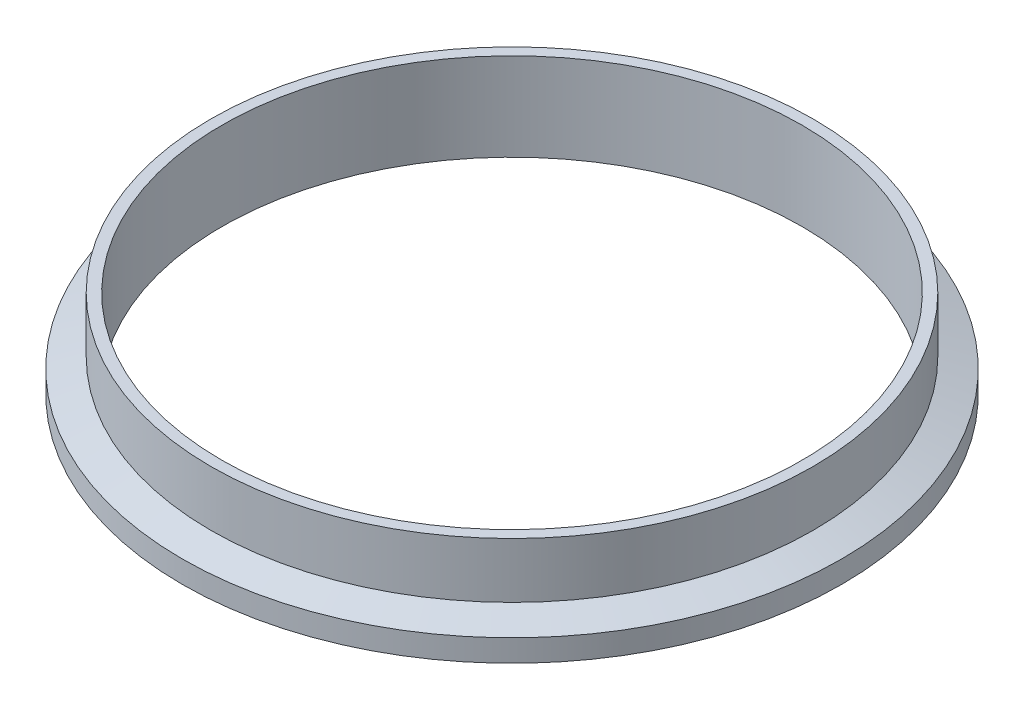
ISO-10303-21;
HEADER;
FILE_DESCRIPTION(('STEP AP214'),'2;1');
FILE_NAME('part.step','',(''),(''),'','','');
FILE_SCHEMA(('AUTOMOTIVE_DESIGN { 1 0 10303 214 1 1 1 1 }'));
ENDSEC;
DATA;
#1=APPLICATION_CONTEXT('core data for automotive mechanical design processes');
#2=APPLICATION_PROTOCOL_DEFINITION('international standard','automotive_design',2000,#1);
#3=PRODUCT_CONTEXT('',#1,'mechanical');
#4=PRODUCT('Part','Part','',(#3));
#5=PRODUCT_RELATED_PRODUCT_CATEGORY('part','',(#4));
#6=PRODUCT_DEFINITION_FORMATION('','',#4);
#7=PRODUCT_DEFINITION_CONTEXT('part definition',#1,'design');
#8=PRODUCT_DEFINITION('design','',#6,#7);
#9=PRODUCT_DEFINITION_SHAPE('','',#8);
#10=(LENGTH_UNIT() NAMED_UNIT(*) SI_UNIT(.MILLI.,.METRE.));
#11=(NAMED_UNIT(*) PLANE_ANGLE_UNIT() SI_UNIT($,.RADIAN.));
#12=(NAMED_UNIT(*) SI_UNIT($,.STERADIAN.) SOLID_ANGLE_UNIT());
#13=UNCERTAINTY_MEASURE_WITH_UNIT(LENGTH_MEASURE(1.E-05),#10,'distance_accuracy_value','');
#14=(GEOMETRIC_REPRESENTATION_CONTEXT(3) GLOBAL_UNCERTAINTY_ASSIGNED_CONTEXT((#13)) GLOBAL_UNIT_ASSIGNED_CONTEXT((#10,
#11,#12)) REPRESENTATION_CONTEXT('',''));
#15=CARTESIAN_POINT('',(0.,0.,0.));
#16=DIRECTION('',(0.,0.,1.));
#17=DIRECTION('',(1.,0.,0.));
#18=AXIS2_PLACEMENT_3D('',#15,#16,#17);
#19=CARTESIAN_POINT('',(0.,0.787400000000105,0.));
#20=DIRECTION('',(0.,-0.999999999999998,0.));
#21=DIRECTION('',(0.,0.,-0.999999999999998));
#22=AXIS2_PLACEMENT_3D('',#19,#20,#21);
#23=TOROIDAL_SURFACE('',#22,79.9992084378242,0.787400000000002);
#24=CARTESIAN_POINT('',(0.,0.,0.));
#25=DIRECTION('',(0.,-0.999999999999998,0.));
#26=DIRECTION('',(0.,0.,-0.999999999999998));
#27=AXIS2_PLACEMENT_3D('',#24,#25,#26);
#28=CIRCLE('',#27,79.9992084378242);
#29=CARTESIAN_POINT('',(0.,0.,-79.999208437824));
#30=VERTEX_POINT('',#29);
#31=EDGE_CURVE('E64',#30,#30,#28,.T.);
#32=ORIENTED_EDGE('',*,*,#31,.T.);
#33=EDGE_LOOP('',(#32));
#34=FACE_BOUND('',#33,.T.);
#35=CARTESIAN_POINT('',(0.,0.474458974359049,0.));
#36=DIRECTION('',(0.,-0.999999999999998,0.));
#37=DIRECTION('',(0.,0.,-0.999999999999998));
#38=AXIS2_PLACEMENT_3D('',#35,#36,#37);
#39=CIRCLE('',#38,79.2766666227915);
#40=CARTESIAN_POINT('',(0.,0.474458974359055,-79.2766666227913));
#41=VERTEX_POINT('',#40);
#42=EDGE_CURVE('E10',#41,#41,#39,.T.);
#43=ORIENTED_EDGE('',*,*,#42,.F.);
#44=EDGE_LOOP('',(#43));
#45=FACE_BOUND('',#44,.T.);
#46=ADVANCED_FACE('F30',(#34,#45),#23,.T.);
#47=CARTESIAN_POINT('',(0.,0.,0.));
#48=DIRECTION('',(0.,-0.999999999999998,0.));
#49=DIRECTION('',(0.,0.,-0.999999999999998));
#50=AXIS2_PLACEMENT_3D('',#47,#48,#49);
#51=TOROIDAL_SURFACE('',#50,78.1812,1.1938);
#52=CARTESIAN_POINT('',(0.,0.474458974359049,0.));
#53=DIRECTION('',(0.,-0.999999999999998,0.));
#54=DIRECTION('',(0.,0.,-0.999999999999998));
#55=AXIS2_PLACEMENT_3D('',#52,#53,#54);
#56=CIRCLE('',#55,77.0857333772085);
#57=CARTESIAN_POINT('',(0.,0.474458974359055,-77.0857333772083));
#58=VERTEX_POINT('',#57);
#59=EDGE_CURVE('E36',#58,#58,#56,.T.);
#60=ORIENTED_EDGE('',*,*,#59,.F.);
#61=EDGE_LOOP('',(#60));
#62=FACE_BOUND('',#61,.T.);
#63=ORIENTED_EDGE('',*,*,#42,.T.);
#64=EDGE_LOOP('',(#63));
#65=FACE_BOUND('',#64,.T.);
#66=ADVANCED_FACE('F112',(#62,#65),#51,.F.);
#67=CARTESIAN_POINT('',(0.,0.787400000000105,0.));
#68=DIRECTION('',(0.,-0.999999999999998,0.));
#69=DIRECTION('',(0.,0.,-0.999999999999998));
#70=AXIS2_PLACEMENT_3D('',#67,#68,#69);
#71=TOROIDAL_SURFACE('',#70,76.3631915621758,0.787399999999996);
#72=ORIENTED_EDGE('',*,*,#59,.T.);
#73=EDGE_LOOP('',(#72));
#74=FACE_BOUND('',#73,.T.);
#75=CARTESIAN_POINT('',(0.,0.,0.));
#76=DIRECTION('',(0.,-0.999999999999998,0.));
#77=DIRECTION('',(0.,0.,-0.999999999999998));
#78=AXIS2_PLACEMENT_3D('',#75,#76,#77);
#79=CIRCLE('',#78,76.3631915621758);
#80=CARTESIAN_POINT('',(0.,0.,-76.3631915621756));
#81=VERTEX_POINT('',#80);
#82=EDGE_CURVE('E40',#81,#81,#79,.T.);
#83=ORIENTED_EDGE('',*,*,#82,.F.);
#84=EDGE_LOOP('',(#83));
#85=FACE_BOUND('',#84,.T.);
#86=ADVANCED_FACE('F108',(#74,#85),#71,.T.);
#87=CARTESIAN_POINT('',(0.,0.,0.));
#88=DIRECTION('',(0.,0.999999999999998,0.));
#89=DIRECTION('',(0.,0.,0.999999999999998));
#90=AXIS2_PLACEMENT_3D('',#87,#88,#89);
#91=PLANE('',#90);
#92=CARTESIAN_POINT('',(0.,0.,0.));
#93=DIRECTION('',(0.,-0.999999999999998,0.));
#94=DIRECTION('',(0.,0.,-0.999999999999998));
#95=AXIS2_PLACEMENT_3D('',#92,#93,#94);
#96=CIRCLE('',#95,73.4314);
#97=CARTESIAN_POINT('',(0.,0.,-73.4313999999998));
#98=VERTEX_POINT('',#97);
#99=EDGE_CURVE('E44',#98,#98,#96,.T.);
#100=ORIENTED_EDGE('',*,*,#99,.F.);
#101=EDGE_LOOP('',(#100));
#102=FACE_BOUND('',#101,.T.);
#103=ORIENTED_EDGE('',*,*,#82,.T.);
#104=EDGE_LOOP('',(#103));
#105=FACE_BOUND('',#104,.T.);
#106=ADVANCED_FACE('F102',(#102,#105),#91,.F.);
#107=CARTESIAN_POINT('',(0.,0.,0.));
#108=DIRECTION('',(0.,-0.999999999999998,0.));
#109=DIRECTION('',(0.,0.,-0.999999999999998));
#110=AXIS2_PLACEMENT_3D('',#107,#108,#109);
#111=CYLINDRICAL_SURFACE('',#110,73.4314);
#112=CARTESIAN_POINT('',(0.,22.2249999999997,0.));
#113=DIRECTION('',(0.,-0.999999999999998,0.));
#114=DIRECTION('',(0.,0.,-0.999999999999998));
#115=AXIS2_PLACEMENT_3D('',#112,#113,#114);
#116=CIRCLE('',#115,73.4314);
#117=CARTESIAN_POINT('',(0.,22.2249999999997,-73.4313999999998));
#118=VERTEX_POINT('',#117);
#119=EDGE_CURVE('E49',#118,#118,#116,.T.);
#120=CARTESIAN_POINT('',(0.,0.,-73.4313999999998));
#121=CARTESIAN_POINT('',(0.,0.231510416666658,-73.4313999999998));
#122=CARTESIAN_POINT('',(0.,0.463020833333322,-73.4313999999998));
#123=CARTESIAN_POINT('',(0.,0.926041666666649,-73.4313999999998));
#124=CARTESIAN_POINT('',(0.,1.15755208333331,-73.4313999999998));
#125=CARTESIAN_POINT('',(0.,1.62057291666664,-73.4313999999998));
#126=CARTESIAN_POINT('',(0.,1.8520833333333,-73.4313999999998));
#127=CARTESIAN_POINT('',(0.,2.31510416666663,-73.4313999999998));
#128=CARTESIAN_POINT('',(0.,2.54661458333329,-73.4313999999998));
#129=CARTESIAN_POINT('',(0.,3.00963541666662,-73.4313999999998));
#130=CARTESIAN_POINT('',(0.,3.24114583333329,-73.4313999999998));
#131=CARTESIAN_POINT('',(0.,3.70416666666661,-73.4313999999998));
#132=CARTESIAN_POINT('',(0.,3.93567708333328,-73.4313999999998));
#133=CARTESIAN_POINT('',(0.,4.3986979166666,-73.4313999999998));
#134=CARTESIAN_POINT('',(0.,4.63020833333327,-73.4313999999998));
#135=CARTESIAN_POINT('',(0.,5.0932291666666,-73.4313999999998));
#136=CARTESIAN_POINT('',(0.,5.32473958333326,-73.4313999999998));
#137=CARTESIAN_POINT('',(0.,5.78776041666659,-73.4313999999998));
#138=CARTESIAN_POINT('',(0.,6.01927083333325,-73.4313999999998));
#139=CARTESIAN_POINT('',(0.,6.48229166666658,-73.4313999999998));
#140=CARTESIAN_POINT('',(0.,6.71380208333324,-73.4313999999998));
#141=CARTESIAN_POINT('',(0.,7.17682291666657,-73.4313999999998));
#142=CARTESIAN_POINT('',(0.,7.40833333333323,-73.4313999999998));
#143=CARTESIAN_POINT('',(0.,7.87135416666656,-73.4313999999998));
#144=CARTESIAN_POINT('',(0.,8.10286458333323,-73.4313999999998));
#145=CARTESIAN_POINT('',(0.,8.56588541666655,-73.4313999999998));
#146=CARTESIAN_POINT('',(0.,8.79739583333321,-73.4313999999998));
#147=CARTESIAN_POINT('',(0.,9.26041666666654,-73.4313999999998));
#148=CARTESIAN_POINT('',(0.,9.49192708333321,-73.4313999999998));
#149=CARTESIAN_POINT('',(0.,9.95494791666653,-73.4313999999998));
#150=CARTESIAN_POINT('',(0.,10.1864583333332,-73.4313999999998));
#151=CARTESIAN_POINT('',(0.,10.6494791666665,-73.4313999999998));
#152=CARTESIAN_POINT('',(0.,10.8809895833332,-73.4313999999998));
#153=CARTESIAN_POINT('',(0.,11.3440104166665,-73.4313999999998));
#154=CARTESIAN_POINT('',(0.,11.5755208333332,-73.4313999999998));
#155=CARTESIAN_POINT('',(0.,12.0385416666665,-73.4313999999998));
#156=CARTESIAN_POINT('',(0.,12.2700520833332,-73.4313999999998));
#157=CARTESIAN_POINT('',(0.,12.7330729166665,-73.4313999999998));
#158=CARTESIAN_POINT('',(0.,12.9645833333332,-73.4313999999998));
#159=CARTESIAN_POINT('',(0.,13.4276041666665,-73.4313999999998));
#160=CARTESIAN_POINT('',(0.,13.6591145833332,-73.4313999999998));
#161=CARTESIAN_POINT('',(0.,14.1221354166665,-73.4313999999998));
#162=CARTESIAN_POINT('',(0.,14.3536458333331,-73.4313999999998));
#163=CARTESIAN_POINT('',(0.,14.8166666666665,-73.4313999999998));
#164=CARTESIAN_POINT('',(0.,15.0481770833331,-73.4313999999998));
#165=CARTESIAN_POINT('',(0.,15.5111979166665,-73.4313999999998));
#166=CARTESIAN_POINT('',(0.,15.7427083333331,-73.4313999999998));
#167=CARTESIAN_POINT('',(0.,16.2057291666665,-73.4313999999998));
#168=CARTESIAN_POINT('',(0.,16.4372395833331,-73.4313999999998));
#169=CARTESIAN_POINT('',(0.,16.9002604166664,-73.4313999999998));
#170=CARTESIAN_POINT('',(0.,17.1317708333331,-73.4313999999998));
#171=CARTESIAN_POINT('',(0.,17.5947916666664,-73.4313999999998));
#172=CARTESIAN_POINT('',(0.,17.8263020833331,-73.4313999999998));
#173=CARTESIAN_POINT('',(0.,18.2893229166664,-73.4313999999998));
#174=CARTESIAN_POINT('',(0.,18.5208333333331,-73.4313999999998));
#175=CARTESIAN_POINT('',(0.,18.9838541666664,-73.4313999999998));
#176=CARTESIAN_POINT('',(0.,19.2153645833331,-73.4313999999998));
#177=CARTESIAN_POINT('',(0.,19.6783854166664,-73.4313999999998));
#178=CARTESIAN_POINT('',(0.,19.9098958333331,-73.4313999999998));
#179=CARTESIAN_POINT('',(0.,20.3729166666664,-73.4313999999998));
#180=CARTESIAN_POINT('',(0.,20.6044270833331,-73.4313999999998));
#181=CARTESIAN_POINT('',(0.,21.0674479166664,-73.4313999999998));
#182=CARTESIAN_POINT('',(0.,21.2989583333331,-73.4313999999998));
#183=CARTESIAN_POINT('',(0.,21.7619791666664,-73.4313999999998));
#184=CARTESIAN_POINT('',(0.,21.993489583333,-73.4313999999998));
#185=CARTESIAN_POINT('',(0.,22.2249999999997,-73.4313999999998));
#186=B_SPLINE_CURVE_WITH_KNOTS('',3,(#120,#121,#122,#123,#124,#125,#126,#127,#128,#129,#130,
#131,#132,#133,#134,#135,#136,#137,#138,#139,#140,#141,#142,#143,#144,#145,#146,#147,#148,#149,
#150,#151,#152,#153,#154,#155,#156,#157,#158,#159,#160,#161,#162,#163,#164,#165,#166,#167,#168,
#169,#170,#171,#172,#173,#174,#175,#176,#177,#178,#179,#180,#181,#182,#183,#184,#185),
.UNSPECIFIED.,.F.,.F.,(4,2,2,2,2,2,2,2,2,2,2,2,2,2,2,2,2,2,2,2,2,2,2,2,2,2,2,2,2,2,2,2,4),(0.,
0.694531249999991,1.38906249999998,2.08359374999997,2.77812499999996,3.47265624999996,
4.16718749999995,4.86171874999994,5.55624999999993,6.25078124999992,6.94531249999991,
7.6398437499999,8.33437499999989,9.02890624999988,9.72343749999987,10.4179687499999,
11.1124999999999,11.8070312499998,12.5015624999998,13.1960937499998,13.8906249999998,
14.5851562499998,15.2796874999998,15.9742187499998,16.6687499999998,17.3632812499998,
18.0578124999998,18.7523437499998,19.4468749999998,20.1414062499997,20.8359374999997,
21.5304687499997,22.2249999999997),.UNSPECIFIED.);
#187=EDGE_CURVE('BSEAM97',#98,#118,#186,.T.);
#188=ORIENTED_EDGE('',*,*,#99,.T.);
#189=ORIENTED_EDGE('',*,*,#119,.F.);
#190=ORIENTED_EDGE('',*,*,#187,.T.);
#191=ORIENTED_EDGE('',*,*,#187,.F.);
#192=EDGE_LOOP('',(#188,#190,#189,#191));
#193=FACE_BOUND('',#192,.T.);
#194=ADVANCED_FACE('F97',(#193),#111,.F.);
#195=CARTESIAN_POINT('',(0.,22.2249999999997,0.));
#196=DIRECTION('',(0.,-0.999999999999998,0.));
#197=DIRECTION('',(0.,0.,-0.999999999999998));
#198=AXIS2_PLACEMENT_3D('',#195,#196,#197);
#199=PLANE('',#198);
#200=CARTESIAN_POINT('',(0.,22.2249999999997,0.));
#201=DIRECTION('',(0.,-0.999999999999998,0.));
#202=DIRECTION('',(0.,0.,-0.999999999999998));
#203=AXIS2_PLACEMENT_3D('',#200,#201,#202);
#204=CIRCLE('',#203,76.2);
#205=CARTESIAN_POINT('',(0.,22.2249999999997,-76.1999999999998));
#206=VERTEX_POINT('',#205);
#207=EDGE_CURVE('E52',#206,#206,#204,.T.);
#208=ORIENTED_EDGE('',*,*,#207,.F.);
#209=EDGE_LOOP('',(#208));
#210=FACE_BOUND('',#209,.T.);
#211=ORIENTED_EDGE('',*,*,#119,.T.);
#212=EDGE_LOOP('',(#211));
#213=FACE_BOUND('',#212,.T.);
#214=ADVANCED_FACE('F91',(#210,#213),#199,.F.);
#215=CARTESIAN_POINT('',(0.,0.,0.));
#216=DIRECTION('',(0.,-0.999999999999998,0.));
#217=DIRECTION('',(0.,0.,-0.999999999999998));
#218=AXIS2_PLACEMENT_3D('',#215,#216,#217);
#219=CYLINDRICAL_SURFACE('',#218,76.2);
#220=CARTESIAN_POINT('',(0.,8.22278052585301,0.));
#221=DIRECTION('',(0.,-0.999999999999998,0.));
#222=DIRECTION('',(0.,0.,-0.999999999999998));
#223=AXIS2_PLACEMENT_3D('',#220,#221,#222);
#224=CIRCLE('',#223,76.2);
#225=CARTESIAN_POINT('',(0.,8.22278052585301,-76.1999999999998));
#226=VERTEX_POINT('',#225);
#227=EDGE_CURVE('E55',#226,#226,#224,.T.);
#228=CARTESIAN_POINT('',(0.,8.22278052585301,-76.1999999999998));
#229=CARTESIAN_POINT('',(0.,8.3686369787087,-76.1999999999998));
#230=CARTESIAN_POINT('',(0.,8.51449343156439,-76.1999999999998));
#231=CARTESIAN_POINT('',(0.,8.80620633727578,-76.1999999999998));
#232=CARTESIAN_POINT('',(0.,8.95206279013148,-76.1999999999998));
#233=CARTESIAN_POINT('',(0.,9.24377569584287,-76.1999999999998));
#234=CARTESIAN_POINT('',(0.,9.38963214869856,-76.1999999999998));
#235=CARTESIAN_POINT('',(0.,9.68134505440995,-76.1999999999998));
#236=CARTESIAN_POINT('',(0.,9.82720150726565,-76.1999999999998));
#237=CARTESIAN_POINT('',(0.,10.118914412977,-76.1999999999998));
#238=CARTESIAN_POINT('',(0.,10.2647708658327,-76.1999999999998));
#239=CARTESIAN_POINT('',(0.,10.5564837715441,-76.1999999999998));
#240=CARTESIAN_POINT('',(0.,10.7023402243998,-76.1999999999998));
#241=CARTESIAN_POINT('',(0.,10.9940531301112,-76.1999999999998));
#242=CARTESIAN_POINT('',(0.,11.1399095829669,-76.1999999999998));
#243=CARTESIAN_POINT('',(0.,11.4316224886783,-76.1999999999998));
#244=CARTESIAN_POINT('',(0.,11.577478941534,-76.1999999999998));
#245=CARTESIAN_POINT('',(0.,11.8691918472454,-76.1999999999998));
#246=CARTESIAN_POINT('',(0.,12.0150483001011,-76.1999999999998));
#247=CARTESIAN_POINT('',(0.,12.3067612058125,-76.1999999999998));
#248=CARTESIAN_POINT('',(0.,12.4526176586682,-76.1999999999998));
#249=CARTESIAN_POINT('',(0.,12.7443305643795,-76.1999999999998));
#250=CARTESIAN_POINT('',(0.,12.8901870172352,-76.1999999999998));
#251=CARTESIAN_POINT('',(0.,13.1818999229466,-76.1999999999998));
#252=CARTESIAN_POINT('',(0.,13.3277563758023,-76.1999999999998));
#253=CARTESIAN_POINT('',(0.,13.6194692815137,-76.1999999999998));
#254=CARTESIAN_POINT('',(0.,13.7653257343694,-76.1999999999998));
#255=CARTESIAN_POINT('',(0.,14.0570386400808,-76.1999999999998));
#256=CARTESIAN_POINT('',(0.,14.2028950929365,-76.1999999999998));
#257=CARTESIAN_POINT('',(0.,14.4946079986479,-76.1999999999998));
#258=CARTESIAN_POINT('',(0.,14.6404644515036,-76.1999999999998));
#259=CARTESIAN_POINT('',(0.,14.932177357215,-76.1999999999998));
#260=CARTESIAN_POINT('',(0.,15.0780338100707,-76.1999999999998));
#261=CARTESIAN_POINT('',(0.,15.3697467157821,-76.1999999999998));
#262=CARTESIAN_POINT('',(0.,15.5156031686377,-76.1999999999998));
#263=CARTESIAN_POINT('',(0.,15.8073160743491,-76.1999999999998));
#264=CARTESIAN_POINT('',(0.,15.9531725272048,-76.1999999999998));
#265=CARTESIAN_POINT('',(0.,16.2448854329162,-76.1999999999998));
#266=CARTESIAN_POINT('',(0.,16.3907418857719,-76.1999999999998));
#267=CARTESIAN_POINT('',(0.,16.6824547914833,-76.1999999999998));
#268=CARTESIAN_POINT('',(0.,16.828311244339,-76.1999999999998));
#269=CARTESIAN_POINT('',(0.,17.1200241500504,-76.1999999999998));
#270=CARTESIAN_POINT('',(0.,17.2658806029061,-76.1999999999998));
#271=CARTESIAN_POINT('',(0.,17.5575935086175,-76.1999999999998));
#272=CARTESIAN_POINT('',(0.,17.7034499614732,-76.1999999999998));
#273=CARTESIAN_POINT('',(0.,17.9951628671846,-76.1999999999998));
#274=CARTESIAN_POINT('',(0.,18.1410193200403,-76.1999999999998));
#275=CARTESIAN_POINT('',(0.,18.4327322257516,-76.1999999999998));
#276=CARTESIAN_POINT('',(0.,18.5785886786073,-76.1999999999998));
#277=CARTESIAN_POINT('',(0.,18.8703015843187,-76.1999999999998));
#278=CARTESIAN_POINT('',(0.,19.0161580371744,-76.1999999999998));
#279=CARTESIAN_POINT('',(0.,19.3078709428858,-76.1999999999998));
#280=CARTESIAN_POINT('',(0.,19.4537273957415,-76.1999999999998));
#281=CARTESIAN_POINT('',(0.,19.7454403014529,-76.1999999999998));
#282=CARTESIAN_POINT('',(0.,19.8912967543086,-76.1999999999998));
#283=CARTESIAN_POINT('',(0.,20.18300966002,-76.1999999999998));
#284=CARTESIAN_POINT('',(0.,20.3288661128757,-76.1999999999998));
#285=CARTESIAN_POINT('',(0.,20.6205790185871,-76.1999999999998));
#286=CARTESIAN_POINT('',(0.,20.7664354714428,-76.1999999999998));
#287=CARTESIAN_POINT('',(0.,21.0581483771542,-76.1999999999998));
#288=CARTESIAN_POINT('',(0.,21.2040048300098,-76.1999999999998));
#289=CARTESIAN_POINT('',(0.,21.4957177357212,-76.1999999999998));
#290=CARTESIAN_POINT('',(0.,21.6415741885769,-76.1999999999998));
#291=CARTESIAN_POINT('',(0.,21.9332870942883,-76.1999999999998));
#292=CARTESIAN_POINT('',(0.,22.079143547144,-76.1999999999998));
#293=CARTESIAN_POINT('',(0.,22.2249999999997,-76.1999999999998));
#294=B_SPLINE_CURVE_WITH_KNOTS('',3,(#228,#229,#230,#231,#232,#233,#234,#235,#236,#237,#238,
#239,#240,#241,#242,#243,#244,#245,#246,#247,#248,#249,#250,#251,#252,#253,#254,#255,#256,#257,
#258,#259,#260,#261,#262,#263,#264,#265,#266,#267,#268,#269,#270,#271,#272,#273,#274,#275,#276,
#277,#278,#279,#280,#281,#282,#283,#284,#285,#286,#287,#288,#289,#290,#291,#292,#293),
.UNSPECIFIED.,.F.,.F.,(4,2,2,2,2,2,2,2,2,2,2,2,2,2,2,2,2,2,2,2,2,2,2,2,2,2,2,2,2,2,2,2,4),(0.,
0.437569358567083,0.875138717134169,1.31270807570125,1.75027743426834,2.18784679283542,
2.62541615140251,3.06298550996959,3.50055486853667,3.93812422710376,4.37569358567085,
4.81326294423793,5.25083230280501,5.6884016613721,6.12597101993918,6.56354037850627,
7.00110973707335,7.43867909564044,7.87624845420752,8.31381781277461,8.75138717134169,
9.18895652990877,9.62652588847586,10.0640952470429,10.50166460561,10.9392339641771,
11.3768033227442,11.8143726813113,12.2519420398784,12.6895113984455,13.1270807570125,
13.5646501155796,14.0022194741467),.UNSPECIFIED.);
#295=EDGE_CURVE('BSEAM85',#226,#206,#294,.T.);
#296=ORIENTED_EDGE('',*,*,#227,.F.);
#297=ORIENTED_EDGE('',*,*,#207,.T.);
#298=ORIENTED_EDGE('',*,*,#295,.T.);
#299=ORIENTED_EDGE('',*,*,#295,.F.);
#300=EDGE_LOOP('',(#296,#298,#297,#299));
#301=FACE_BOUND('',#300,.T.);
#302=ADVANCED_FACE('F85',(#301),#219,.T.);
#303=CARTESIAN_POINT('',(0.,8.22278052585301,0.));
#304=DIRECTION('',(0.,-0.999999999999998,0.));
#305=DIRECTION('',(0.,0.,-0.999999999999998));
#306=AXIS2_PLACEMENT_3D('',#303,#304,#305);
#307=CONICAL_SURFACE('',#306,76.2,1.22173047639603);
#308=CARTESIAN_POINT('',(0.,5.58799999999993,0.));
#309=DIRECTION('',(0.,-0.999999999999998,0.));
#310=DIRECTION('',(0.,0.,-0.999999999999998));
#311=AXIS2_PLACEMENT_3D('',#308,#309,#310);
#312=CIRCLE('',#311,83.439);
#313=CARTESIAN_POINT('',(0.,5.58799999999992,-83.4390000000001));
#314=VERTEX_POINT('',#313);
#315=EDGE_CURVE('E58',#314,#314,#312,.T.);
#316=CARTESIAN_POINT('',(0.,5.58799999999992,-83.4390000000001));
#317=CARTESIAN_POINT('',(0.,5.61544563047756,-83.3635937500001));
#318=CARTESIAN_POINT('',(0.,5.64289126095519,-83.2881875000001));
#319=CARTESIAN_POINT('',(0.,5.69778252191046,-83.137375));
#320=CARTESIAN_POINT('',(0.,5.7252281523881,-83.0619687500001));
#321=CARTESIAN_POINT('',(0.,5.78011941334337,-82.91115625));
#322=CARTESIAN_POINT('',(0.,5.80756504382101,-82.8357500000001));
#323=CARTESIAN_POINT('',(0.,5.86245630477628,-82.6849375));
#324=CARTESIAN_POINT('',(0.,5.88990193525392,-82.60953125));
#325=CARTESIAN_POINT('',(0.,5.94479319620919,-82.45871875));
#326=CARTESIAN_POINT('',(0.,5.97223882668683,-82.3833125));
#327=CARTESIAN_POINT('',(0.,6.0271300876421,-82.2325));
#328=CARTESIAN_POINT('',(0.,6.05457571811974,-82.15709375));
#329=CARTESIAN_POINT('',(0.,6.10946697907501,-82.00628125));
#330=CARTESIAN_POINT('',(0.,6.13691260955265,-81.930875));
#331=CARTESIAN_POINT('',(0.,6.19180387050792,-81.7800625));
#332=CARTESIAN_POINT('',(0.,6.21924950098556,-81.70465625));
#333=CARTESIAN_POINT('',(0.,6.27414076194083,-81.55384375));
#334=CARTESIAN_POINT('',(0.,6.30158639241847,-81.4784375));
#335=CARTESIAN_POINT('',(0.,6.35647765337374,-81.327625));
#336=CARTESIAN_POINT('',(0.,6.38392328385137,-81.25221875));
#337=CARTESIAN_POINT('',(0.,6.43881454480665,-81.10140625));
#338=CARTESIAN_POINT('',(0.,6.46626017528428,-81.026));
#339=CARTESIAN_POINT('',(0.,6.52115143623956,-80.8751875));
#340=CARTESIAN_POINT('',(0.,6.54859706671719,-80.79978125));
#341=CARTESIAN_POINT('',(0.,6.60348832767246,-80.64896875));
#342=CARTESIAN_POINT('',(0.,6.6309339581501,-80.5735625));
#343=CARTESIAN_POINT('',(0.,6.68582521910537,-80.42275));
#344=CARTESIAN_POINT('',(0.,6.71327084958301,-80.34734375));
#345=CARTESIAN_POINT('',(0.,6.76816211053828,-80.19653125));
#346=CARTESIAN_POINT('',(0.,6.79560774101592,-80.121125));
#347=CARTESIAN_POINT('',(0.,6.85049900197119,-79.9703125));
#348=CARTESIAN_POINT('',(0.,6.87794463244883,-79.89490625));
#349=CARTESIAN_POINT('',(0.,6.9328358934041,-79.7440937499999));
#350=CARTESIAN_POINT('',(0.,6.96028152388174,-79.6686875));
#351=CARTESIAN_POINT('',(0.,7.01517278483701,-79.5178749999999));
#352=CARTESIAN_POINT('',(0.,7.04261841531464,-79.4424687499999));
#353=CARTESIAN_POINT('',(0.,7.09750967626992,-79.2916562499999));
#354=CARTESIAN_POINT('',(0.,7.12495530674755,-79.2162499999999));
#355=CARTESIAN_POINT('',(0.,7.17984656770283,-79.0654374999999));
#356=CARTESIAN_POINT('',(0.,7.20729219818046,-78.9900312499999));
#357=CARTESIAN_POINT('',(0.,7.26218345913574,-78.8392187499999));
#358=CARTESIAN_POINT('',(0.,7.28962908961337,-78.7638124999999));
#359=CARTESIAN_POINT('',(0.,7.34452035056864,-78.6129999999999));
#360=CARTESIAN_POINT('',(0.,7.37196598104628,-78.5375937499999));
#361=CARTESIAN_POINT('',(0.,7.42685724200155,-78.3867812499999));
#362=CARTESIAN_POINT('',(0.,7.45430287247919,-78.3113749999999));
#363=CARTESIAN_POINT('',(0.,7.50919413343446,-78.1605624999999));
#364=CARTESIAN_POINT('',(0.,7.5366397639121,-78.0851562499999));
#365=CARTESIAN_POINT('',(0.,7.59153102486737,-77.9343437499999));
#366=CARTESIAN_POINT('',(0.,7.61897665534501,-77.8589374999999));
#367=CARTESIAN_POINT('',(0.,7.67386791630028,-77.7081249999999));
#368=CARTESIAN_POINT('',(0.,7.70131354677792,-77.6327187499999));
#369=CARTESIAN_POINT('',(0.,7.75620480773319,-77.4819062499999));
#370=CARTESIAN_POINT('',(0.,7.78365043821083,-77.4064999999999));
#371=CARTESIAN_POINT('',(0.,7.8385416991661,-77.2556874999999));
#372=CARTESIAN_POINT('',(0.,7.86598732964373,-77.1802812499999));
#373=CARTESIAN_POINT('',(0.,7.92087859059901,-77.0294687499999));
#374=CARTESIAN_POINT('',(0.,7.94832422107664,-76.9540624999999));
#375=CARTESIAN_POINT('',(0.,8.00321548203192,-76.8032499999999));
#376=CARTESIAN_POINT('',(0.,8.03066111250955,-76.7278437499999));
#377=CARTESIAN_POINT('',(0.,8.08555237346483,-76.5770312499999));
#378=CARTESIAN_POINT('',(0.,8.11299800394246,-76.5016249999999));
#379=CARTESIAN_POINT('',(0.,8.16788926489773,-76.3508124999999));
#380=CARTESIAN_POINT('',(0.,8.19533489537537,-76.2754062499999));
#381=CARTESIAN_POINT('',(0.,8.22278052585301,-76.1999999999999));
#382=B_SPLINE_CURVE_WITH_KNOTS('',3,(#316,#317,#318,#319,#320,#321,#322,#323,#324,#325,#326,
#327,#328,#329,#330,#331,#332,#333,#334,#335,#336,#337,#338,#339,#340,#341,#342,#343,#344,#345,
#346,#347,#348,#349,#350,#351,#352,#353,#354,#355,#356,#357,#358,#359,#360,#361,#362,#363,#364,
#365,#366,#367,#368,#369,#370,#371,#372,#373,#374,#375,#376,#377,#378,#379,#380,#381),
.UNSPECIFIED.,.F.,.F.,(4,2,2,2,2,2,2,2,2,2,2,2,2,2,2,2,2,2,2,2,2,2,2,2,2,2,2,2,2,2,2,2,4),(0.,
0.240736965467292,0.481473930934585,0.722210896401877,0.962947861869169,1.20368482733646,
1.44442179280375,1.68515875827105,1.92589572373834,2.16663268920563,2.40736965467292,
2.64810662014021,2.88884358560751,3.1295805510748,3.37031751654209,3.61105448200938,
3.85179144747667,4.09252841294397,4.33326537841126,4.57400234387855,4.81473930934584,
5.05547627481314,5.29621324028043,5.53695020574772,5.777687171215,6.01842413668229,
6.25916110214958,6.49989806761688,6.74063503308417,6.98137199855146,7.22210896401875,
7.46284592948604,7.70358289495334),.UNSPECIFIED.);
#383=EDGE_CURVE('BSEAM79',#314,#226,#382,.T.);
#384=ORIENTED_EDGE('',*,*,#315,.F.);
#385=ORIENTED_EDGE('',*,*,#227,.T.);
#386=ORIENTED_EDGE('',*,*,#383,.T.);
#387=ORIENTED_EDGE('',*,*,#383,.F.);
#388=EDGE_LOOP('',(#384,#386,#385,#387));
#389=FACE_BOUND('',#388,.T.);
#390=ADVANCED_FACE('F79',(#389),#307,.T.);
#391=CARTESIAN_POINT('',(0.,0.,0.));
#392=DIRECTION('',(0.,-0.999999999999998,0.));
#393=DIRECTION('',(0.,0.,-0.999999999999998));
#394=AXIS2_PLACEMENT_3D('',#391,#392,#393);
#395=CYLINDRICAL_SURFACE('',#394,83.439);
#396=CARTESIAN_POINT('',(0.,0.,0.));
#397=DIRECTION('',(0.,-0.999999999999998,0.));
#398=DIRECTION('',(0.,0.,-0.999999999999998));
#399=AXIS2_PLACEMENT_3D('',#396,#397,#398);
#400=CIRCLE('',#399,83.439);
#401=CARTESIAN_POINT('',(0.,0.,-83.4389999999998));
#402=VERTEX_POINT('',#401);
#403=EDGE_CURVE('E61',#402,#402,#400,.T.);
#404=CARTESIAN_POINT('',(0.,0.,-83.4389999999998));
#405=CARTESIAN_POINT('',(0.,0.0582083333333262,-83.4389999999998));
#406=CARTESIAN_POINT('',(0.,0.116416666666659,-83.4389999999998));
#407=CARTESIAN_POINT('',(0.,0.232833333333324,-83.4389999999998));
#408=CARTESIAN_POINT('',(0.,0.291041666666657,-83.4389999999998));
#409=CARTESIAN_POINT('',(0.,0.407458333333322,-83.4389999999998));
#410=CARTESIAN_POINT('',(0.,0.465666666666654,-83.4389999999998));
#411=CARTESIAN_POINT('',(0.,0.582083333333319,-83.4389999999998));
#412=CARTESIAN_POINT('',(0.,0.640291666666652,-83.4389999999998));
#413=CARTESIAN_POINT('',(0.,0.756708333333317,-83.4389999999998));
#414=CARTESIAN_POINT('',(0.,0.81491666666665,-83.4389999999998));
#415=CARTESIAN_POINT('',(0.,0.931333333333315,-83.4389999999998));
#416=CARTESIAN_POINT('',(0.,0.989541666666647,-83.4389999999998));
#417=CARTESIAN_POINT('',(0.,1.10595833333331,-83.4389999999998));
#418=CARTESIAN_POINT('',(0.,1.16416666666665,-83.4389999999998));
#419=CARTESIAN_POINT('',(0.,1.28058333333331,-83.4389999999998));
#420=CARTESIAN_POINT('',(0.,1.33879166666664,-83.4389999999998));
#421=CARTESIAN_POINT('',(0.,1.45520833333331,-83.4389999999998));
#422=CARTESIAN_POINT('',(0.,1.51341666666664,-83.4389999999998));
#423=CARTESIAN_POINT('',(0.,1.62983333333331,-83.4389999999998));
#424=CARTESIAN_POINT('',(0.,1.68804166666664,-83.4389999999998));
#425=CARTESIAN_POINT('',(0.,1.8044583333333,-83.4389999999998));
#426=CARTESIAN_POINT('',(0.,1.86266666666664,-83.4389999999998));
#427=CARTESIAN_POINT('',(0.,1.9790833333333,-83.4389999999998));
#428=CARTESIAN_POINT('',(0.,2.03729166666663,-83.4389999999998));
#429=CARTESIAN_POINT('',(0.,2.1537083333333,-83.4389999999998));
#430=CARTESIAN_POINT('',(0.,2.21191666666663,-83.4389999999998));
#431=CARTESIAN_POINT('',(0.,2.3283333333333,-83.4389999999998));
#432=CARTESIAN_POINT('',(0.,2.38654166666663,-83.4389999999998));
#433=CARTESIAN_POINT('',(0.,2.50295833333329,-83.4389999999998));
#434=CARTESIAN_POINT('',(0.,2.56116666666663,-83.4389999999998));
#435=CARTESIAN_POINT('',(0.,2.67758333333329,-83.4389999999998));
#436=CARTESIAN_POINT('',(0.,2.73579166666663,-83.4389999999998));
#437=CARTESIAN_POINT('',(0.,2.85220833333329,-83.4389999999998));
#438=CARTESIAN_POINT('',(0.,2.91041666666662,-83.4389999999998));
#439=CARTESIAN_POINT('',(0.,3.02683333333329,-83.4389999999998));
#440=CARTESIAN_POINT('',(0.,3.08504166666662,-83.4389999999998));
#441=CARTESIAN_POINT('',(0.,3.20145833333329,-83.4389999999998));
#442=CARTESIAN_POINT('',(0.,3.25966666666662,-83.4389999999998));
#443=CARTESIAN_POINT('',(0.,3.37608333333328,-83.4389999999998));
#444=CARTESIAN_POINT('',(0.,3.43429166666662,-83.4389999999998));
#445=CARTESIAN_POINT('',(0.,3.55070833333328,-83.4389999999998));
#446=CARTESIAN_POINT('',(0.,3.60891666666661,-83.4389999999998));
#447=CARTESIAN_POINT('',(0.,3.72533333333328,-83.4389999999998));
#448=CARTESIAN_POINT('',(0.,3.78354166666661,-83.4389999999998));
#449=CARTESIAN_POINT('',(0.,3.89995833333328,-83.4389999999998));
#450=CARTESIAN_POINT('',(0.,3.95816666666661,-83.4389999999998));
#451=CARTESIAN_POINT('',(0.,4.07458333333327,-83.4389999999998));
#452=CARTESIAN_POINT('',(0.,4.13279166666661,-83.4389999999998));
#453=CARTESIAN_POINT('',(0.,4.24920833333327,-83.4389999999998));
#454=CARTESIAN_POINT('',(0.,4.3074166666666,-83.4389999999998));
#455=CARTESIAN_POINT('',(0.,4.42383333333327,-83.4389999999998));
#456=CARTESIAN_POINT('',(0.,4.4820416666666,-83.4389999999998));
#457=CARTESIAN_POINT('',(0.,4.59845833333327,-83.4389999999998));
#458=CARTESIAN_POINT('',(0.,4.6566666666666,-83.4389999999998));
#459=CARTESIAN_POINT('',(0.,4.77308333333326,-83.4389999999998));
#460=CARTESIAN_POINT('',(0.,4.8312916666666,-83.4389999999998));
#461=CARTESIAN_POINT('',(0.,4.94770833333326,-83.4389999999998));
#462=CARTESIAN_POINT('',(0.,5.00591666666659,-83.4389999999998));
#463=CARTESIAN_POINT('',(0.,5.12233333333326,-83.4389999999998));
#464=CARTESIAN_POINT('',(0.,5.18054166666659,-83.4389999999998));
#465=CARTESIAN_POINT('',(0.,5.29695833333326,-83.4389999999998));
#466=CARTESIAN_POINT('',(0.,5.35516666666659,-83.4389999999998));
#467=CARTESIAN_POINT('',(0.,5.47158333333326,-83.4389999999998));
#468=CARTESIAN_POINT('',(0.,5.52979166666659,-83.4389999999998));
#469=CARTESIAN_POINT('',(0.,5.58799999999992,-83.4389999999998));
#470=B_SPLINE_CURVE_WITH_KNOTS('',3,(#404,#405,#406,#407,#408,#409,#410,#411,#412,#413,#414,
#415,#416,#417,#418,#419,#420,#421,#422,#423,#424,#425,#426,#427,#428,#429,#430,#431,#432,#433,
#434,#435,#436,#437,#438,#439,#440,#441,#442,#443,#444,#445,#446,#447,#448,#449,#450,#451,#452,
#453,#454,#455,#456,#457,#458,#459,#460,#461,#462,#463,#464,#465,#466,#467,#468,#469),
.UNSPECIFIED.,.F.,.F.,(4,2,2,2,2,2,2,2,2,2,2,2,2,2,2,2,2,2,2,2,2,2,2,2,2,2,2,2,2,2,2,2,4),(0.,
0.174624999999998,0.349249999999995,0.523874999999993,0.698499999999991,0.873124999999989,
1.04774999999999,1.22237499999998,1.39699999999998,1.57162499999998,1.74624999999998,
1.92087499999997,2.09549999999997,2.27012499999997,2.44474999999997,2.61937499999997,
2.79399999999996,2.96862499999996,3.14324999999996,3.31787499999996,3.49249999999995,
3.66712499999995,3.84174999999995,4.01637499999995,4.19099999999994,4.36562499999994,
4.54024999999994,4.71487499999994,4.88949999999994,5.06412499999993,5.23874999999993,
5.41337499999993,5.58799999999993),.UNSPECIFIED.);
#471=EDGE_CURVE('BSEAM73',#402,#314,#470,.T.);
#472=ORIENTED_EDGE('',*,*,#403,.F.);
#473=ORIENTED_EDGE('',*,*,#315,.T.);
#474=ORIENTED_EDGE('',*,*,#471,.T.);
#475=ORIENTED_EDGE('',*,*,#471,.F.);
#476=EDGE_LOOP('',(#472,#474,#473,#475));
#477=FACE_BOUND('',#476,.T.);
#478=ADVANCED_FACE('F73',(#477),#395,.T.);
#479=CARTESIAN_POINT('',(0.,0.,0.));
#480=DIRECTION('',(0.,0.999999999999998,0.));
#481=DIRECTION('',(0.,0.,0.999999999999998));
#482=AXIS2_PLACEMENT_3D('',#479,#480,#481);
#483=PLANE('',#482);
#484=ORIENTED_EDGE('',*,*,#31,.F.);
#485=EDGE_LOOP('',(#484));
#486=FACE_BOUND('',#485,.T.);
#487=ORIENTED_EDGE('',*,*,#403,.T.);
#488=EDGE_LOOP('',(#487));
#489=FACE_BOUND('',#488,.T.);
#490=ADVANCED_FACE('F70',(#486,#489),#483,.F.);
#491=CLOSED_SHELL('',(#46,#66,#86,#106,#194,#214,#302,#390,#478,#490));
#492=MANIFOLD_SOLID_BREP('B2',#491);
#493=ADVANCED_BREP_SHAPE_REPRESENTATION('',(#18,#492),#14);
#494=SHAPE_DEFINITION_REPRESENTATION(#9,#493);
ENDSEC;
END-ISO-10303-21;
